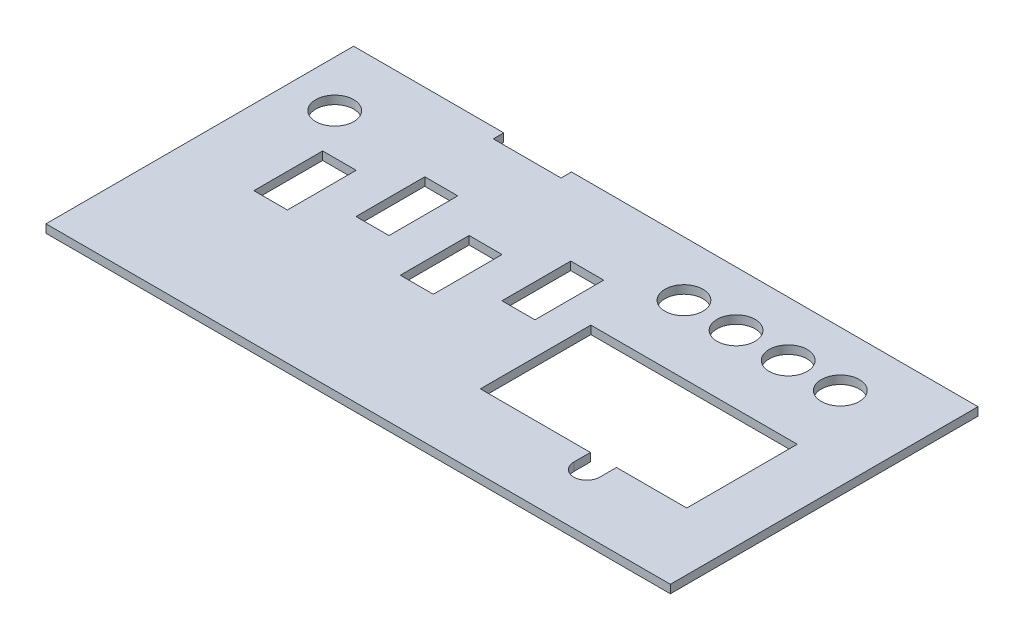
from build123d import *

# Parameters (mm, degrees)
SKETCH1_W           = 150
SKETCH1_H           = 70
BOSS_EXTRUDE1_DEPTH = 1.5875
SKETCH3_OUTSIDE_W   = 185.108
SKETCH3_OUTSIDE_H   = 105.108
CUT_EXTRUDE1_DEPTH  = 10
SKETCH6_R           = 3.65
SKETCH6_R_2         = 3.6
SKETCH6_W           = 39.6
SKETCH6_H           = 21.2
SKETCH6_W_2         = 6.331
SKETCH6_H_2         = 13.1965578
SKETCH6_W_3         = 6.4255
CUT_EXTRUDE2_DEPTH  = 68.015905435
CUT_EXTRUDE3_DEPTH  = 68.015905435


with BuildPart() as part:
    # Sketch1 → Boss-Extrude1 (new body)
    with BuildSketch(Plane(origin=(0, 0, 0), x_dir=(1, 0, 0), z_dir=(0, 1, 0))):
        Rectangle(SKETCH1_W, SKETCH1_H)
    extrude(amount=BOSS_EXTRUDE1_DEPTH)

    # Sketch3 outside → Cut-Extrude1 (cut)
    with BuildSketch(Plane.XZ):
        Rectangle(SKETCH3_OUTSIDE_W, SKETCH3_OUTSIDE_H)
        Polygon((59.895, -30.02), (59.895, 29), (-59.895, 29), (-59.895, -30.02), (-31.1, -30.02), (-31.1, -28.02), (-18.1, -28.02), (-18.1, -30.02), align=None, mode=Mode.SUBTRACT)
    extrude(amount=-CUT_EXTRUDE1_DEPTH, mode=Mode.SUBTRACT)

    # Sketch6 → Cut-Extrude2 (cut, through all)
    with BuildSketch(Plane(origin=(0, 1.5875, 0), x_dir=(1, 0, 0), z_dir=(0, 1, 0))):
        with Locations(Location((14, 19.5, 0), (0, 0, 270))):
            Circle(SKETCH6_R)
        with Locations((64.495, 5.21)):
            Circle(SKETCH6_R_2)
        with Locations((-64.495, 5.21)):
            Circle(SKETCH6_R_2)
        with Locations(Location((-51, 17.5, 0), (0, 0, 270))):
            Circle(SKETCH6_R)
        with Locations(Location((24, 19.5, 0), (0, 0, 270))):
            Circle(SKETCH6_R)
        with Locations(Location((34, 19.5, 0), (0, 0, 270))):
            Circle(SKETCH6_R)
        with Locations(Location((44, 19.5, 0), (0, 0, 270))):
            Circle(SKETCH6_R)
        with Locations((29, -4.16)):
            Rectangle(SKETCH6_W, SKETCH6_H)
        with Locations((-14.2, 3.044831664)):
            Rectangle(SKETCH6_W_2, SKETCH6_H_2)
        with Locations((-28.2, 8.544831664)):
            Rectangle(SKETCH6_W_2, SKETCH6_H_2)
        with Locations((-42.24725, 3.044831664)):
            Rectangle(SKETCH6_W_3, SKETCH6_H_2)
        with Locations((-0.2, 8.544831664)):
            Rectangle(SKETCH6_W_2, SKETCH6_H_2)
    extrude(amount=-CUT_EXTRUDE2_DEPTH, mode=Mode.SUBTRACT)

    # Sketch7 → Cut-Extrude3 (cut, through all)
    with BuildSketch(Plane.XZ):
        with BuildLine():
            Line((30.32, 14.76), (35.32, 14.76))
            Line((35.32, 14.76), (35.32, 17.96))
            ThreePointArc((35.32, 17.96), (32.82, 20.46), (30.32, 17.96))
            Line((30.32, 17.96), (30.32, 14.76))
        make_face()
    extrude(amount=-CUT_EXTRUDE3_DEPTH, mode=Mode.SUBTRACT)


solid = part.part
